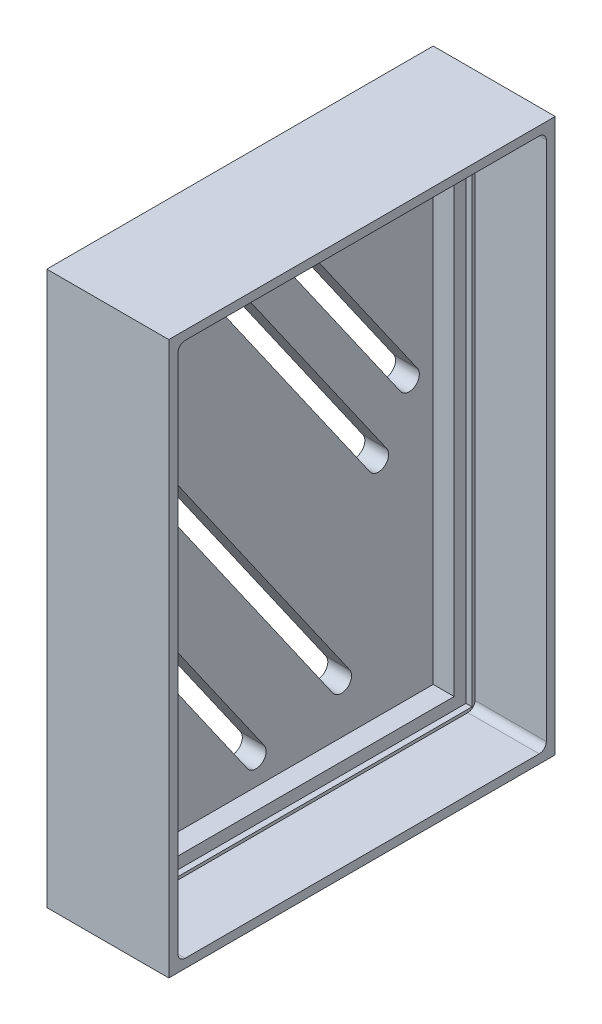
from build123d import *

# Parameters (mm, degrees)
SKETCH1_W           = 32.5
SKETCH1_H           = 46.5
BOSS_EXTRUDE2_DEPTH = 10.261196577
SHELL1_T            = -2
CUT_EXTRUDE1_DEPTH  = 6
SKETCH3_R           = 1.5
BOSS_EXTRUDE3_DEPTH = 10.261197
CUT_EXTRUDE2_DEPTH  = 6.5
SKETCH5_W           = 28.5
SKETCH5_H           = 1
CUT_EXTRUDE3_DEPTH  = 6.5
CUT_EXTRUDE4_DEPTH  = 6.5
CUT_EXTRUDE5_DEPTH  = 6
SKETCH9_W           = 20.936862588
SKETCH9_H           = 0.25
CUT_EXTRUDE6_DEPTH  = 6
FILLET1_R           = 0.6


with BuildPart() as part:
    # Sketch1 → Boss-Extrude2 (new body)
    with BuildSketch(Plane(origin=(0, 0, 0), x_dir=(0, 0, -1), z_dir=(1, 0, 0))):
        with Locations((1.653195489, 2.097744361)):
            Rectangle(SKETCH1_W, SKETCH1_H)
    extrude(amount=BOSS_EXTRUDE2_DEPTH)

    # Shell1
    shell1_openings = [part.faces().sort_by_distance(p)[0] for p in [
        (10.261196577, 2.097744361, -1.653195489),
    ]]
    offset(amount=SHELL1_T, openings=shell1_openings, kind=Kind.INTERSECTION)

    # Sketch2 → Cut-Extrude1 (cut)
    with BuildSketch(Plane.ZY):
        with BuildLine():
            Line((5.438656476, 5.910225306), (-8.88311082, -14.580918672))
            ThreePointArc((-8.88311082, -14.580918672), (-8.670273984, -15.781926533), (-7.469266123, -15.569089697))
            Line((-7.469266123, -15.569089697), (6.852501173, 4.922054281))
            ThreePointArc((6.852501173, 4.922054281), (6.639664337, 6.123062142), (5.438656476, 5.910225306))
        make_face()
        with BuildLine():
            Line((9.762292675, -0.098981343), (-1.695121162, -16.491896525))
            ThreePointArc((-1.695121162, -16.491896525), (-1.482506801, -17.689391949), (-0.285011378, -17.476777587))
            Line((-0.285011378, -17.476777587), (11.17208338, -1.084318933))
            ThreePointArc((11.17208338, -1.084318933), (10.959856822, 0.113245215), (9.762292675, -0.098981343))
        make_face()
        with BuildLine():
            Line((2.323350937, 20.471761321), (-11.998416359, -0.019382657))
            ThreePointArc((-11.998416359, -0.019382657), (-11.785579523, -1.220390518), (-10.584571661, -1.007553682))
            Line((-10.584571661, -1.007553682), (3.737195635, 19.483590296))
            ThreePointArc((3.737195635, 19.483590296), (3.524358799, 20.684598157), (2.323350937, 20.471761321))
        make_face()
        with BuildLine():
            Line((-3.125347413, 20.917445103), (-14.581484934, 4.526356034))
            ThreePointArc((-14.581484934, 4.526356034), (-14.368482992, 3.328930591), (-13.171057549, 3.541932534))
            Line((-13.171057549, 3.541932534), (-1.715558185, 19.932108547))
            ThreePointArc((-1.715558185, 19.932108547), (-1.927784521, 21.129671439), (-3.125347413, 20.917445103))
        make_face()
    extrude(amount=-CUT_EXTRUDE1_DEPTH, mode=Mode.SUBTRACT)

    # Sketch3 → Boss-Extrude3 (add)
    with BuildSketch(Plane(origin=(10.261196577, 0, 0), x_dir=(0, 0, -1), z_dir=(1, 0, 0))):
        with Locations((15.903195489, 23.347744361)):
            Circle(SKETCH3_R)
        with Locations((-12.596804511, -19.152255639)):
            Circle(SKETCH3_R)
    extrude(amount=-BOSS_EXTRUDE3_DEPTH)

    # Sketch4 → Cut-Extrude2 (cut)
    with BuildSketch(Plane(origin=(10.261196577, 0, 0), x_dir=(0, 0, -1), z_dir=(1, 0, 0))):
        Polygon((-13.572559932, 24.347744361), (-13.572559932, -20.152255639), (-12.596804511, -20.152255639), (-12.596804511, 23.347744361), (15.903195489, 23.347744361), (15.903195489, -20.152255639), (16.903195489, -20.152255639), (16.903195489, 24.347744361), align=None)
    extrude(amount=-CUT_EXTRUDE2_DEPTH, mode=Mode.SUBTRACT)

    # Sketch5 → Cut-Extrude3 (cut)
    with BuildSketch(Plane(origin=(10.261196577, 0, 0), x_dir=(0, 0, -1), z_dir=(1, 0, 0))):
        with Locations((1.653195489, -19.652255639)):
            Rectangle(SKETCH5_W, SKETCH5_H)
    extrude(amount=-CUT_EXTRUDE3_DEPTH, mode=Mode.SUBTRACT)

    # Sketch6 → Cut-Extrude4 (cut)
    with BuildSketch(Plane(origin=(10.261196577, 0, 0), x_dir=(0, 0, -1), z_dir=(1, 0, 0))):
        with BuildLine():
            Line((-12.596804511, -17.652255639), (-12.596804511, -19.152255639))
            Line((-12.596804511, -19.152255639), (-11.096804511, -19.152255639))
            ThreePointArc((-11.096804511, -19.152255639), (-11.536144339, -18.091595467), (-12.596804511, -17.652255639))
        make_face()
        with BuildLine():
            Line((15.903195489, 23.347744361), (15.903195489, 21.847744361))
            ThreePointArc((15.903195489, 21.847744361), (14.842535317, 22.287084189), (14.403195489, 23.347744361))
            Line((14.403195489, 23.347744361), (15.903195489, 23.347744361))
        make_face()
    extrude(amount=-CUT_EXTRUDE4_DEPTH, mode=Mode.SUBTRACT)

    # Sketch8 → Cut-Extrude5 (cut)
    with BuildSketch(Plane(origin=(10.261196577, 0, 0), x_dir=(0, 0, -1), z_dir=(1, 0, 0))):
        Polygon((17.153195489, 24.304666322), (17.153195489, -20.402255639), (7.364302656, -20.402255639), (7.364302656, -20.152255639), (16.903195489, -20.152255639), (16.903195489, 24.347744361), (-13.572559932, 24.347744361), (-13.572559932, -20.402255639), (-13.822559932, -20.402255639), (-13.822559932, 19.230791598), (-13.822559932, 24.597744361), (15.426743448, 24.597744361), (17.153195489, 24.597744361), align=None)
    extrude(amount=-CUT_EXTRUDE5_DEPTH, mode=Mode.SUBTRACT)

    # Sketch9 → Cut-Extrude6 (cut)
    with BuildSketch(Plane(origin=(10.261196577, 0, 0), x_dir=(0, 0, -1), z_dir=(1, 0, 0))):
        with Locations((-3.104128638, -20.277255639)):
            Rectangle(SKETCH9_W, SKETCH9_H)
    extrude(amount=-CUT_EXTRUDE6_DEPTH, mode=Mode.SUBTRACT)

    # Fillet1
    fillet1_edges = [part.edges().sort_by_distance(p)[0] for p in [
        (7.261196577, 24.597744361, -17.153195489),
        (7.261196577, -20.402255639, -17.153195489),
        (7.261196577, -20.402255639, 13.822559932),
        (7.261196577, 24.597744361, 13.822559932),
    ]]
    fillet(fillet1_edges, radius=FILLET1_R)


solid = part.part
